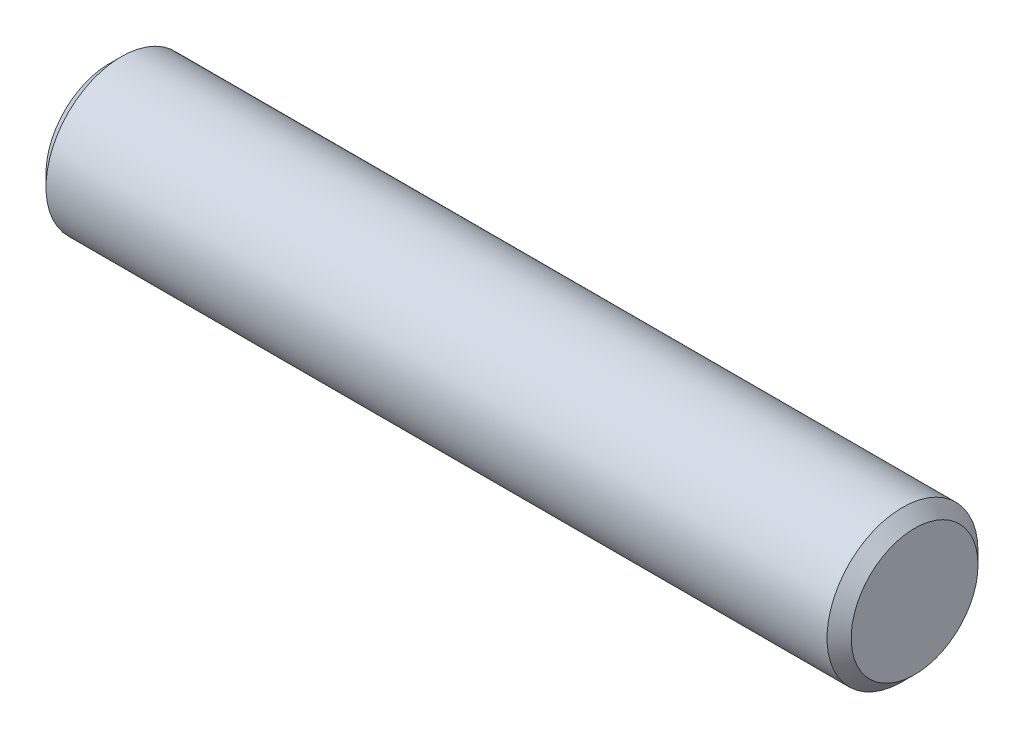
from build123d import *

# Parameters (mm, degrees)
SKETCH1_R      = 2.38125
EXTRUDE1_DEPTH = 25.4
CHAMFER1_SIZE  = 0.381


with BuildPart() as part:
    # Sketch1 → Extrude1 (new body)
    with BuildSketch(Plane(origin=(0, 0, 0), x_dir=(0, 0, -1), z_dir=(1, 0, 0))):
        Circle(SKETCH1_R)
    extrude(amount=EXTRUDE1_DEPTH)

    # Chamfer1
    chamfer1_edges = [part.edges().sort_by_distance(p)[0] for p in [
        (0, 0, 2.38125),
        (25.4, 0, 2.38125),
    ]]
    chamfer(chamfer1_edges, length=CHAMFER1_SIZE)


solid = part.part
